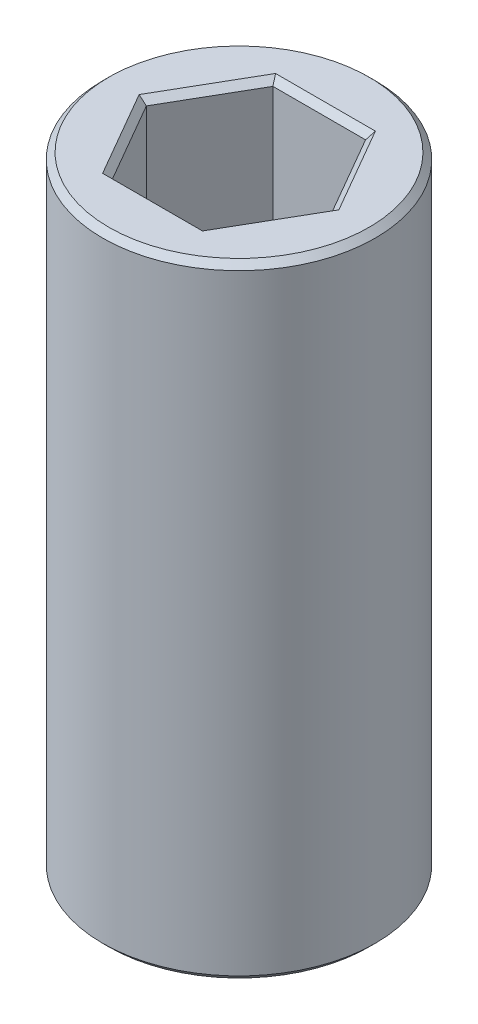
from build123d import *

# Parameters (mm, degrees)
SKETCH1_R           = 11.1125
BOSS_EXTRUDE1_DEPTH = 50.8
CHAMFER1_SIZE       = 0.508


with BuildPart() as part:
    # Sketch1 → Boss-Extrude1 (new body)
    with BuildSketch(Plane(origin=(0, 0, 0), x_dir=(1, 0, 0), z_dir=(0, 1, 0))):
        with Locations(Location((0, 0, 0), (0, 0, 270))):
            Circle(SKETCH1_R)
        Polygon((7.552318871, 0), (3.776159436, 6.5405), (-3.776159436, 6.5405), (-7.552318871, 0), (-3.776159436, -6.5405), (3.776159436, -6.5405), align=None, mode=Mode.SUBTRACT)
    extrude(amount=BOSS_EXTRUDE1_DEPTH)

    # Chamfer1
    chamfer1_edges = [part.edges().sort_by_distance(p)[0] for p in [
        (0, 0, -6.5405),
        (-5.664239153, 0, -3.27025),
        (-5.664239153, 0, 3.27025),
        (0, 0, 6.5405),
        (5.664239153, 50.8, 3.27025),
        (5.664239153, 50.8, -3.27025),
        (0, 50.8, -6.5405),
        (-5.664239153, 50.8, -3.27025),
        (-5.664239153, 50.8, 3.27025),
        (0, 50.8, 6.5405),
        (0, 0, -11.1125),
        (0, 50.8, -11.1125),
        (5.664239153, 0, 3.27025),
        (5.664239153, 0, -3.27025),
    ]]
    chamfer(chamfer1_edges, length=CHAMFER1_SIZE)


solid = part.part
